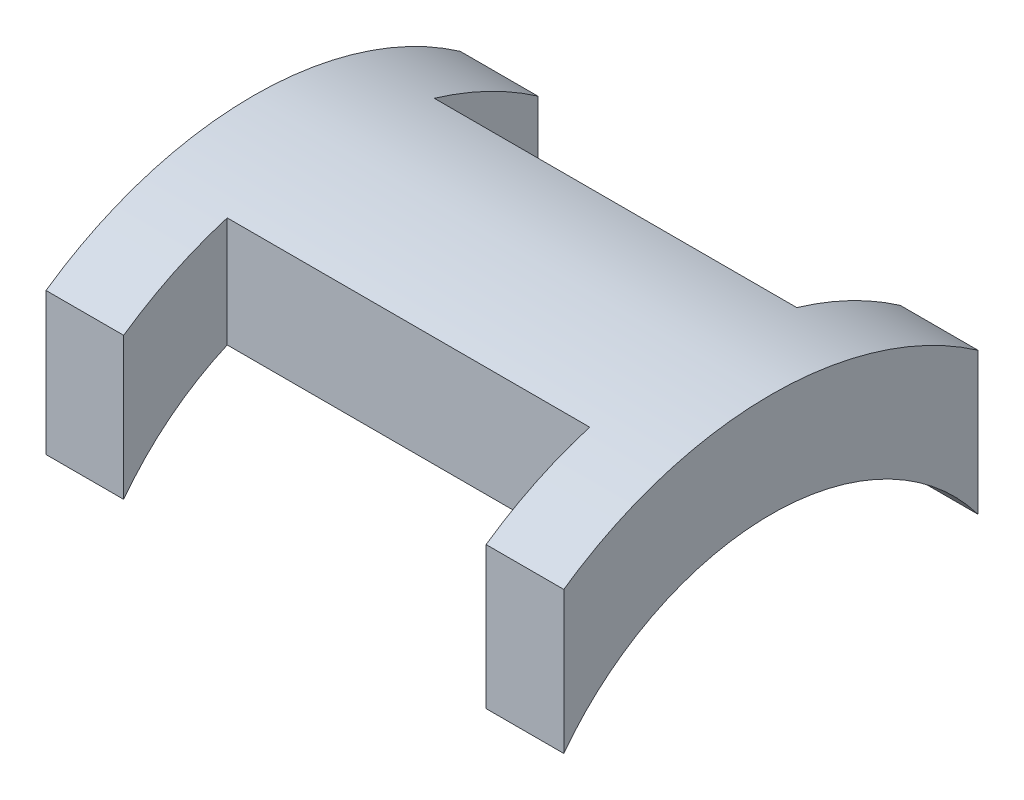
ISO-10303-21;
HEADER;
FILE_DESCRIPTION(('STEP AP214'),'2;1');
FILE_NAME('part.step','',(''),(''),'','','');
FILE_SCHEMA(('AUTOMOTIVE_DESIGN { 1 0 10303 214 1 1 1 1 }'));
ENDSEC;
DATA;
#1=APPLICATION_CONTEXT('core data for automotive mechanical design processes');
#2=APPLICATION_PROTOCOL_DEFINITION('international standard','automotive_design',2000,#1);
#3=PRODUCT_CONTEXT('',#1,'mechanical');
#4=PRODUCT('Part','Part','',(#3));
#5=PRODUCT_RELATED_PRODUCT_CATEGORY('part','',(#4));
#6=PRODUCT_DEFINITION_FORMATION('','',#4);
#7=PRODUCT_DEFINITION_CONTEXT('part definition',#1,'design');
#8=PRODUCT_DEFINITION('design','',#6,#7);
#9=PRODUCT_DEFINITION_SHAPE('','',#8);
#10=(LENGTH_UNIT() NAMED_UNIT(*) SI_UNIT(.MILLI.,.METRE.));
#11=(NAMED_UNIT(*) PLANE_ANGLE_UNIT() SI_UNIT($,.RADIAN.));
#12=(NAMED_UNIT(*) SI_UNIT($,.STERADIAN.) SOLID_ANGLE_UNIT());
#13=UNCERTAINTY_MEASURE_WITH_UNIT(LENGTH_MEASURE(1.E-05),#10,'distance_accuracy_value','');
#14=(GEOMETRIC_REPRESENTATION_CONTEXT(3) GLOBAL_UNCERTAINTY_ASSIGNED_CONTEXT((#13)) GLOBAL_UNIT_ASSIGNED_CONTEXT((#10,
#11,#12)) REPRESENTATION_CONTEXT('',''));
#15=CARTESIAN_POINT('',(0.,0.,0.));
#16=DIRECTION('',(0.,0.,1.));
#17=DIRECTION('',(1.,0.,0.));
#18=AXIS2_PLACEMENT_3D('',#15,#16,#17);
#19=CARTESIAN_POINT('',(100.,0.,0.));
#20=DIRECTION('',(-1.,0.,0.));
#21=DIRECTION('',(0.,0.,1.));
#22=AXIS2_PLACEMENT_3D('',#19,#20,#21);
#23=CYLINDRICAL_SURFACE('',#22,70.);
#24=CARTESIAN_POINT('',(85.,0.,0.));
#25=DIRECTION('',(-1.,0.,0.));
#26=DIRECTION('',(0.,0.,1.));
#27=AXIS2_PLACEMENT_3D('',#24,#25,#26);
#28=CIRCLE('',#27,70.);
#29=CARTESIAN_POINT('',(85.,57.4456264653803,40.));
#30=VERTEX_POINT('',#29);
#31=CARTESIAN_POINT('',(85.,67.0820393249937,20.));
#32=VERTEX_POINT('',#31);
#33=EDGE_CURVE('E162',#30,#32,#28,.T.);
#34=ORIENTED_EDGE('',*,*,#33,.F.);
#35=DIRECTION('',(-1.,0.,0.));
#36=VECTOR('',#35,1.);
#37=CARTESIAN_POINT('',(100.,57.4456264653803,40.));
#38=LINE('',#37,#36);
#39=CARTESIAN_POINT('',(100.,57.4456264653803,40.));
#40=VERTEX_POINT('',#39);
#41=EDGE_CURVE('E150',#40,#30,#38,.T.);
#42=ORIENTED_EDGE('',*,*,#41,.F.);
#43=CARTESIAN_POINT('',(100.,0.,0.));
#44=DIRECTION('',(1.,0.,0.));
#45=DIRECTION('',(0.,0.,-1.));
#46=AXIS2_PLACEMENT_3D('',#43,#44,#45);
#47=CIRCLE('',#46,70.);
#48=CARTESIAN_POINT('',(100.,57.4456264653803,-40.));
#49=VERTEX_POINT('',#48);
#50=EDGE_CURVE('E179',#49,#40,#47,.T.);
#51=ORIENTED_EDGE('',*,*,#50,.F.);
#52=DIRECTION('',(-1.,0.,0.));
#53=VECTOR('',#52,1.);
#54=CARTESIAN_POINT('',(100.,57.4456264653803,-40.));
#55=LINE('',#54,#53);
#56=CARTESIAN_POINT('',(85.,57.4456264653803,-40.));
#57=VERTEX_POINT('',#56);
#58=EDGE_CURVE('E202',#49,#57,#55,.T.);
#59=ORIENTED_EDGE('',*,*,#58,.T.);
#60=CARTESIAN_POINT('',(85.,0.,0.));
#61=DIRECTION('',(-1.,0.,0.));
#62=DIRECTION('',(0.,0.,1.));
#63=AXIS2_PLACEMENT_3D('',#60,#61,#62);
#64=CIRCLE('',#63,70.);
#65=CARTESIAN_POINT('',(85.,67.0820393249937,-20.));
#66=VERTEX_POINT('',#65);
#67=EDGE_CURVE('E53',#66,#57,#64,.T.);
#68=ORIENTED_EDGE('',*,*,#67,.F.);
#69=DIRECTION('',(-1.,0.,0.));
#70=VECTOR('',#69,1.);
#71=CARTESIAN_POINT('',(100.,67.0820393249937,-20.));
#72=LINE('',#71,#70);
#73=CARTESIAN_POINT('',(15.,67.0820393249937,-20.));
#74=VERTEX_POINT('',#73);
#75=EDGE_CURVE('E192',#74,#66,#72,.F.);
#76=ORIENTED_EDGE('',*,*,#75,.F.);
#77=CARTESIAN_POINT('',(15.,0.,0.));
#78=DIRECTION('',(1.,0.,0.));
#79=DIRECTION('',(0.,0.,-1.));
#80=AXIS2_PLACEMENT_3D('',#77,#78,#79);
#81=CIRCLE('',#80,70.);
#82=CARTESIAN_POINT('',(15.,57.4456264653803,-40.));
#83=VERTEX_POINT('',#82);
#84=EDGE_CURVE('E207',#83,#74,#81,.T.);
#85=ORIENTED_EDGE('',*,*,#84,.F.);
#86=CARTESIAN_POINT('',(0.,57.4456264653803,-40.));
#87=VERTEX_POINT('',#86);
#88=EDGE_CURVE('E197',#83,#87,#55,.T.);
#89=ORIENTED_EDGE('',*,*,#88,.T.);
#90=CARTESIAN_POINT('',(0.,0.,0.));
#91=DIRECTION('',(1.,0.,0.));
#92=DIRECTION('',(0.,0.,-1.));
#93=AXIS2_PLACEMENT_3D('',#90,#91,#92);
#94=CIRCLE('',#93,70.);
#95=CARTESIAN_POINT('',(0.,57.4456264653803,40.));
#96=VERTEX_POINT('',#95);
#97=EDGE_CURVE('E198',#87,#96,#94,.T.);
#98=ORIENTED_EDGE('',*,*,#97,.T.);
#99=CARTESIAN_POINT('',(15.,57.4456264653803,40.));
#100=VERTEX_POINT('',#99);
#101=EDGE_CURVE('E144',#100,#96,#38,.T.);
#102=ORIENTED_EDGE('',*,*,#101,.F.);
#103=CARTESIAN_POINT('',(15.,0.,0.));
#104=DIRECTION('',(1.,0.,0.));
#105=DIRECTION('',(0.,0.,-1.));
#106=AXIS2_PLACEMENT_3D('',#103,#104,#105);
#107=CIRCLE('',#106,70.);
#108=CARTESIAN_POINT('',(15.,67.0820393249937,20.));
#109=VERTEX_POINT('',#108);
#110=EDGE_CURVE('E45',#109,#100,#107,.T.);
#111=ORIENTED_EDGE('',*,*,#110,.F.);
#112=DIRECTION('',(-1.,0.,0.));
#113=VECTOR('',#112,1.);
#114=CARTESIAN_POINT('',(100.,67.0820393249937,20.));
#115=LINE('',#114,#113);
#116=EDGE_CURVE('E171',#32,#109,#115,.T.);
#117=ORIENTED_EDGE('',*,*,#116,.F.);
#118=EDGE_LOOP('',(#34,#42,#51,#59,#68,#76,#85,#89,#98,#102,#111,#117));
#119=FACE_BOUND('',#118,.T.);
#120=ADVANCED_FACE('F31',(#119),#23,.T.);
#121=CARTESIAN_POINT('',(100.,0.,0.));
#122=DIRECTION('',(-1.,0.,0.));
#123=DIRECTION('',(0.,0.,1.));
#124=AXIS2_PLACEMENT_3D('',#121,#122,#123);
#125=CYLINDRICAL_SURFACE('',#124,50.);
#126=CARTESIAN_POINT('',(85.,0.,0.));
#127=DIRECTION('',(-1.,0.,0.));
#128=DIRECTION('',(0.,0.,1.));
#129=AXIS2_PLACEMENT_3D('',#126,#127,#128);
#130=CIRCLE('',#129,50.);
#131=CARTESIAN_POINT('',(85.,45.8257569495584,20.));
#132=VERTEX_POINT('',#131);
#133=CARTESIAN_POINT('',(85.,30.,40.));
#134=VERTEX_POINT('',#133);
#135=EDGE_CURVE('E164',#132,#134,#130,.F.);
#136=ORIENTED_EDGE('',*,*,#135,.F.);
#137=DIRECTION('',(-1.,0.,0.));
#138=VECTOR('',#137,1.);
#139=CARTESIAN_POINT('',(100.,45.8257569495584,20.));
#140=LINE('',#139,#138);
#141=CARTESIAN_POINT('',(15.,45.8257569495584,20.));
#142=VERTEX_POINT('',#141);
#143=EDGE_CURVE('E11',#142,#132,#140,.F.);
#144=ORIENTED_EDGE('',*,*,#143,.F.);
#145=CARTESIAN_POINT('',(15.,0.,0.));
#146=DIRECTION('',(1.,0.,0.));
#147=DIRECTION('',(0.,0.,-1.));
#148=AXIS2_PLACEMENT_3D('',#145,#146,#147);
#149=CIRCLE('',#148,50.);
#150=CARTESIAN_POINT('',(15.,30.,40.));
#151=VERTEX_POINT('',#150);
#152=EDGE_CURVE('E120',#151,#142,#149,.F.);
#153=ORIENTED_EDGE('',*,*,#152,.F.);
#154=DIRECTION('',(-1.,0.,0.));
#155=VECTOR('',#154,1.);
#156=CARTESIAN_POINT('',(100.,30.,40.));
#157=LINE('',#156,#155);
#158=CARTESIAN_POINT('',(0.,30.,40.));
#159=VERTEX_POINT('',#158);
#160=EDGE_CURVE('E132',#151,#159,#157,.T.);
#161=ORIENTED_EDGE('',*,*,#160,.T.);
#162=CARTESIAN_POINT('',(0.,0.,0.));
#163=DIRECTION('',(-1.,0.,0.));
#164=DIRECTION('',(0.,0.,-1.));
#165=AXIS2_PLACEMENT_3D('',#162,#163,#164);
#166=CIRCLE('',#165,50.);
#167=CARTESIAN_POINT('',(0.,30.,-40.));
#168=VERTEX_POINT('',#167);
#169=EDGE_CURVE('E189',#159,#168,#166,.T.);
#170=ORIENTED_EDGE('',*,*,#169,.T.);
#171=DIRECTION('',(-1.,0.,0.));
#172=VECTOR('',#171,1.);
#173=CARTESIAN_POINT('',(100.,30.,-40.));
#174=LINE('',#173,#172);
#175=CARTESIAN_POINT('',(15.,30.,-40.));
#176=VERTEX_POINT('',#175);
#177=EDGE_CURVE('E146',#176,#168,#174,.T.);
#178=ORIENTED_EDGE('',*,*,#177,.F.);
#179=CARTESIAN_POINT('',(15.,0.,0.));
#180=DIRECTION('',(1.,0.,0.));
#181=DIRECTION('',(0.,0.,-1.));
#182=AXIS2_PLACEMENT_3D('',#179,#180,#181);
#183=CIRCLE('',#182,50.);
#184=CARTESIAN_POINT('',(15.,45.8257569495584,-20.));
#185=VERTEX_POINT('',#184);
#186=EDGE_CURVE('E217',#185,#176,#183,.F.);
#187=ORIENTED_EDGE('',*,*,#186,.F.);
#188=DIRECTION('',(-1.,0.,0.));
#189=VECTOR('',#188,1.);
#190=CARTESIAN_POINT('',(100.,45.8257569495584,-20.));
#191=LINE('',#190,#189);
#192=CARTESIAN_POINT('',(85.,45.8257569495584,-20.));
#193=VERTEX_POINT('',#192);
#194=EDGE_CURVE('E125',#193,#185,#191,.T.);
#195=ORIENTED_EDGE('',*,*,#194,.F.);
#196=CARTESIAN_POINT('',(85.,0.,0.));
#197=DIRECTION('',(-1.,0.,0.));
#198=DIRECTION('',(0.,0.,1.));
#199=AXIS2_PLACEMENT_3D('',#196,#197,#198);
#200=CIRCLE('',#199,50.);
#201=CARTESIAN_POINT('',(85.,30.,-40.));
#202=VERTEX_POINT('',#201);
#203=EDGE_CURVE('E222',#202,#193,#200,.F.);
#204=ORIENTED_EDGE('',*,*,#203,.F.);
#205=CARTESIAN_POINT('',(100.,30.,-40.));
#206=VERTEX_POINT('',#205);
#207=EDGE_CURVE('E141',#206,#202,#174,.T.);
#208=ORIENTED_EDGE('',*,*,#207,.F.);
#209=CARTESIAN_POINT('',(100.,0.,0.));
#210=DIRECTION('',(-1.,0.,0.));
#211=DIRECTION('',(0.,0.,-1.));
#212=AXIS2_PLACEMENT_3D('',#209,#210,#211);
#213=CIRCLE('',#212,50.);
#214=CARTESIAN_POINT('',(100.,30.,40.));
#215=VERTEX_POINT('',#214);
#216=EDGE_CURVE('E178',#215,#206,#213,.T.);
#217=ORIENTED_EDGE('',*,*,#216,.F.);
#218=EDGE_CURVE('E140',#215,#134,#157,.T.);
#219=ORIENTED_EDGE('',*,*,#218,.T.);
#220=EDGE_LOOP('',(#136,#144,#153,#161,#170,#178,#187,#195,#204,#208,#217,#219));
#221=FACE_BOUND('',#220,.T.);
#222=ADVANCED_FACE('F130',(#221),#125,.F.);
#223=CARTESIAN_POINT('',(100.,57.4456264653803,40.));
#224=DIRECTION('',(0.,0.,-1.));
#225=DIRECTION('',(-1.,0.,0.));
#226=AXIS2_PLACEMENT_3D('',#223,#224,#225);
#227=PLANE('',#226);
#228=DIRECTION('',(0.,1.,0.));
#229=VECTOR('',#228,1.);
#230=CARTESIAN_POINT('',(85.,57.4456264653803,40.));
#231=LINE('',#230,#229);
#232=EDGE_CURVE('E38',#134,#30,#231,.T.);
#233=ORIENTED_EDGE('',*,*,#232,.F.);
#234=ORIENTED_EDGE('',*,*,#218,.F.);
#235=DIRECTION('',(0.,-1.,0.));
#236=VECTOR('',#235,1.);
#237=CARTESIAN_POINT('',(100.,57.4456264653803,40.));
#238=LINE('',#237,#236);
#239=EDGE_CURVE('E174',#40,#215,#238,.T.);
#240=ORIENTED_EDGE('',*,*,#239,.F.);
#241=ORIENTED_EDGE('',*,*,#41,.T.);
#242=EDGE_LOOP('',(#233,#234,#240,#241));
#243=FACE_BOUND('',#242,.T.);
#244=ADVANCED_FACE('F173',(#243),#227,.F.);
#245=DIRECTION('',(0.,-1.,0.));
#246=VECTOR('',#245,1.);
#247=CARTESIAN_POINT('',(15.,57.4456264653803,40.));
#248=LINE('',#247,#246);
#249=EDGE_CURVE('E117',#100,#151,#248,.T.);
#250=ORIENTED_EDGE('',*,*,#249,.F.);
#251=ORIENTED_EDGE('',*,*,#101,.T.);
#252=DIRECTION('',(0.,-1.,0.));
#253=VECTOR('',#252,1.);
#254=CARTESIAN_POINT('',(0.,57.4456264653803,40.));
#255=LINE('',#254,#253);
#256=EDGE_CURVE('E138',#96,#159,#255,.T.);
#257=ORIENTED_EDGE('',*,*,#256,.T.);
#258=ORIENTED_EDGE('',*,*,#160,.F.);
#259=EDGE_LOOP('',(#250,#251,#257,#258));
#260=FACE_BOUND('',#259,.T.);
#261=ADVANCED_FACE('F136',(#260),#227,.F.);
#262=CARTESIAN_POINT('',(100.,57.4456264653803,-40.));
#263=DIRECTION('',(0.,0.,1.));
#264=DIRECTION('',(1.,0.,0.));
#265=AXIS2_PLACEMENT_3D('',#262,#263,#264);
#266=PLANE('',#265);
#267=DIRECTION('',(0.,1.,0.));
#268=VECTOR('',#267,1.);
#269=CARTESIAN_POINT('',(15.,57.4456264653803,-40.));
#270=LINE('',#269,#268);
#271=EDGE_CURVE('E155',#176,#83,#270,.T.);
#272=ORIENTED_EDGE('',*,*,#271,.F.);
#273=ORIENTED_EDGE('',*,*,#177,.T.);
#274=DIRECTION('',(0.,1.,0.));
#275=VECTOR('',#274,1.);
#276=CARTESIAN_POINT('',(0.,57.4456264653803,-40.));
#277=LINE('',#276,#275);
#278=EDGE_CURVE('E186',#168,#87,#277,.T.);
#279=ORIENTED_EDGE('',*,*,#278,.T.);
#280=ORIENTED_EDGE('',*,*,#88,.F.);
#281=EDGE_LOOP('',(#272,#273,#279,#280));
#282=FACE_BOUND('',#281,.T.);
#283=ADVANCED_FACE('F211',(#282),#266,.F.);
#284=DIRECTION('',(0.,-1.,0.));
#285=VECTOR('',#284,1.);
#286=CARTESIAN_POINT('',(85.,57.4456264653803,-40.));
#287=LINE('',#286,#285);
#288=EDGE_CURVE('E153',#57,#202,#287,.T.);
#289=ORIENTED_EDGE('',*,*,#288,.F.);
#290=ORIENTED_EDGE('',*,*,#58,.F.);
#291=DIRECTION('',(0.,1.,0.));
#292=VECTOR('',#291,1.);
#293=CARTESIAN_POINT('',(100.,57.4456264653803,-40.));
#294=LINE('',#293,#292);
#295=EDGE_CURVE('E183',#206,#49,#294,.T.);
#296=ORIENTED_EDGE('',*,*,#295,.F.);
#297=ORIENTED_EDGE('',*,*,#207,.T.);
#298=EDGE_LOOP('',(#289,#290,#296,#297));
#299=FACE_BOUND('',#298,.T.);
#300=ADVANCED_FACE('F240',(#299),#266,.F.);
#301=CARTESIAN_POINT('',(100.,0.,0.));
#302=DIRECTION('',(1.,0.,0.));
#303=DIRECTION('',(0.,0.,-1.));
#304=AXIS2_PLACEMENT_3D('',#301,#302,#303);
#305=PLANE('',#304);
#306=ORIENTED_EDGE('',*,*,#50,.T.);
#307=ORIENTED_EDGE('',*,*,#239,.T.);
#308=ORIENTED_EDGE('',*,*,#216,.T.);
#309=ORIENTED_EDGE('',*,*,#295,.T.);
#310=EDGE_LOOP('',(#306,#307,#308,#309));
#311=FACE_BOUND('',#310,.T.);
#312=ADVANCED_FACE('F181',(#311),#305,.T.);
#313=CARTESIAN_POINT('',(0.,0.,0.));
#314=DIRECTION('',(1.,0.,0.));
#315=DIRECTION('',(0.,0.,-1.));
#316=AXIS2_PLACEMENT_3D('',#313,#314,#315);
#317=PLANE('',#316);
#318=ORIENTED_EDGE('',*,*,#97,.F.);
#319=ORIENTED_EDGE('',*,*,#278,.F.);
#320=ORIENTED_EDGE('',*,*,#169,.F.);
#321=ORIENTED_EDGE('',*,*,#256,.F.);
#322=EDGE_LOOP('',(#318,#319,#320,#321));
#323=FACE_BOUND('',#322,.T.);
#324=ADVANCED_FACE('F214',(#323),#317,.F.);
#325=CARTESIAN_POINT('',(15.,70.,-20.));
#326=DIRECTION('',(0.,0.,-1.));
#327=DIRECTION('',(-1.,0.,0.));
#328=AXIS2_PLACEMENT_3D('',#325,#326,#327);
#329=PLANE('',#328);
#330=ORIENTED_EDGE('',*,*,#75,.T.);
#331=DIRECTION('',(0.,-1.,0.));
#332=VECTOR('',#331,1.);
#333=CARTESIAN_POINT('',(85.,70.,-20.));
#334=LINE('',#333,#332);
#335=EDGE_CURVE('E228',#66,#193,#334,.T.);
#336=ORIENTED_EDGE('',*,*,#335,.T.);
#337=ORIENTED_EDGE('',*,*,#194,.T.);
#338=DIRECTION('',(0.,-1.,0.));
#339=VECTOR('',#338,1.);
#340=CARTESIAN_POINT('',(15.,70.,-20.));
#341=LINE('',#340,#339);
#342=EDGE_CURVE('E226',#74,#185,#341,.T.);
#343=ORIENTED_EDGE('',*,*,#342,.F.);
#344=EDGE_LOOP('',(#330,#336,#337,#343));
#345=FACE_BOUND('',#344,.T.);
#346=ADVANCED_FACE('F243',(#345),#329,.T.);
#347=CARTESIAN_POINT('',(15.,70.,-40.));
#348=DIRECTION('',(1.,0.,0.));
#349=DIRECTION('',(0.,0.,-1.));
#350=AXIS2_PLACEMENT_3D('',#347,#348,#349);
#351=PLANE('',#350);
#352=ORIENTED_EDGE('',*,*,#84,.T.);
#353=ORIENTED_EDGE('',*,*,#342,.T.);
#354=ORIENTED_EDGE('',*,*,#186,.T.);
#355=ORIENTED_EDGE('',*,*,#271,.T.);
#356=EDGE_LOOP('',(#352,#353,#354,#355));
#357=FACE_BOUND('',#356,.T.);
#358=ADVANCED_FACE('F245',(#357),#351,.T.);
#359=CARTESIAN_POINT('',(85.,70.,-40.));
#360=DIRECTION('',(-1.,0.,0.));
#361=DIRECTION('',(0.,0.,1.));
#362=AXIS2_PLACEMENT_3D('',#359,#360,#361);
#363=PLANE('',#362);
#364=ORIENTED_EDGE('',*,*,#67,.T.);
#365=ORIENTED_EDGE('',*,*,#288,.T.);
#366=ORIENTED_EDGE('',*,*,#203,.T.);
#367=ORIENTED_EDGE('',*,*,#335,.F.);
#368=EDGE_LOOP('',(#364,#365,#366,#367));
#369=FACE_BOUND('',#368,.T.);
#370=ADVANCED_FACE('F241',(#369),#363,.T.);
#371=CARTESIAN_POINT('',(15.,70.,20.));
#372=DIRECTION('',(0.,0.,1.));
#373=DIRECTION('',(1.,0.,0.));
#374=AXIS2_PLACEMENT_3D('',#371,#372,#373);
#375=PLANE('',#374);
#376=ORIENTED_EDGE('',*,*,#116,.T.);
#377=DIRECTION('',(0.,-1.,0.));
#378=VECTOR('',#377,1.);
#379=CARTESIAN_POINT('',(15.,70.,20.));
#380=LINE('',#379,#378);
#381=EDGE_CURVE('E235',#109,#142,#380,.T.);
#382=ORIENTED_EDGE('',*,*,#381,.T.);
#383=ORIENTED_EDGE('',*,*,#143,.T.);
#384=DIRECTION('',(0.,-1.,0.));
#385=VECTOR('',#384,1.);
#386=CARTESIAN_POINT('',(85.,70.,20.));
#387=LINE('',#386,#385);
#388=EDGE_CURVE('E134',#32,#132,#387,.T.);
#389=ORIENTED_EDGE('',*,*,#388,.F.);
#390=EDGE_LOOP('',(#376,#382,#383,#389));
#391=FACE_BOUND('',#390,.T.);
#392=ADVANCED_FACE('F237',(#391),#375,.T.);
#393=CARTESIAN_POINT('',(85.,70.,40.));
#394=DIRECTION('',(-1.,0.,0.));
#395=DIRECTION('',(0.,0.,1.));
#396=AXIS2_PLACEMENT_3D('',#393,#394,#395);
#397=PLANE('',#396);
#398=ORIENTED_EDGE('',*,*,#33,.T.);
#399=ORIENTED_EDGE('',*,*,#388,.T.);
#400=ORIENTED_EDGE('',*,*,#135,.T.);
#401=ORIENTED_EDGE('',*,*,#232,.T.);
#402=EDGE_LOOP('',(#398,#399,#400,#401));
#403=FACE_BOUND('',#402,.T.);
#404=ADVANCED_FACE('F160',(#403),#397,.T.);
#405=CARTESIAN_POINT('',(15.,70.,40.));
#406=DIRECTION('',(1.,0.,0.));
#407=DIRECTION('',(0.,0.,-1.));
#408=AXIS2_PLACEMENT_3D('',#405,#406,#407);
#409=PLANE('',#408);
#410=ORIENTED_EDGE('',*,*,#110,.T.);
#411=ORIENTED_EDGE('',*,*,#249,.T.);
#412=ORIENTED_EDGE('',*,*,#152,.T.);
#413=ORIENTED_EDGE('',*,*,#381,.F.);
#414=EDGE_LOOP('',(#410,#411,#412,#413));
#415=FACE_BOUND('',#414,.T.);
#416=ADVANCED_FACE('F119',(#415),#409,.T.);
#417=CLOSED_SHELL('',(#120,#222,#244,#261,#283,#300,#312,#324,#346,#358,#370,#392,#404,#416));
#418=MANIFOLD_SOLID_BREP('B2',#417);
#419=ADVANCED_BREP_SHAPE_REPRESENTATION('',(#18,#418),#14);
#420=SHAPE_DEFINITION_REPRESENTATION(#9,#419);
ENDSEC;
END-ISO-10303-21;
